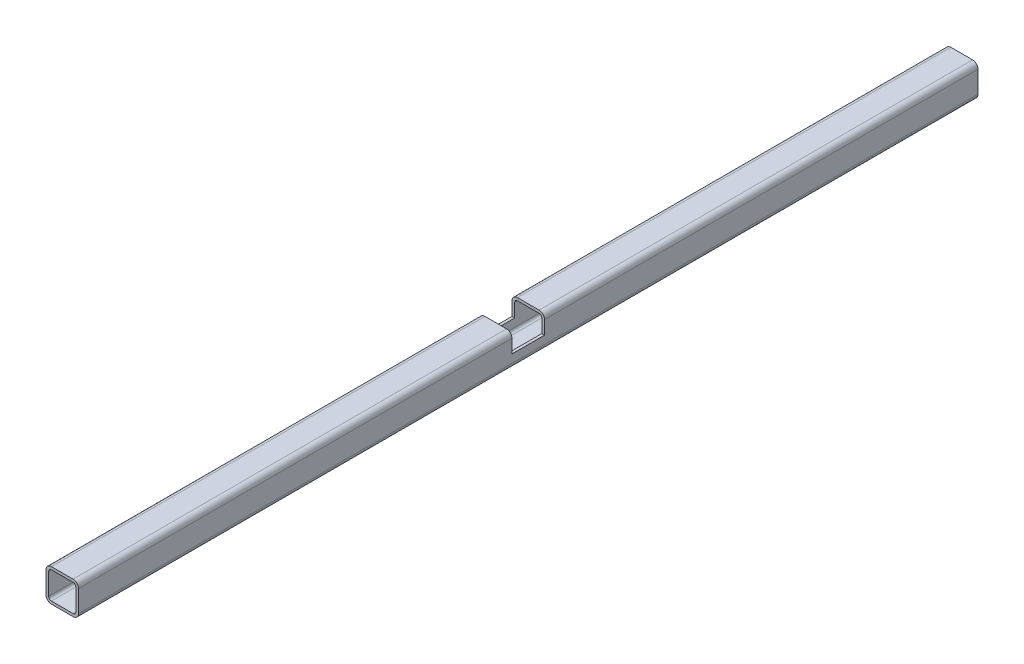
from build123d import *

# Parameters (mm, degrees)
EXTRUSION1_DEPTH = 1660
ESQUISSE1_W      = 60
ESQUISSE1_H      = 35
EXTRUSION2_DEPTH = 1662.354868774


with BuildPart() as part:
    # Sketch1 → Extrusion1 (new body)
    with BuildSketch(Plane.XY):
        with BuildLine():
            Line((-20, -30), (20, -30))
            ThreePointArc((20, -30), (27.071067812, -27.071067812), (30, -20))
            Line((30, -20), (30, 20))
            ThreePointArc((30, 20), (27.071067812, 27.071067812), (20, 30))
            Line((20, 30), (-20, 30))
            ThreePointArc((-20, 30), (-27.071067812, 27.071067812), (-30, 20))
            Line((-30, 20), (-30, -20))
            ThreePointArc((-30, -20), (-27.071067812, -27.071067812), (-20, -30))
        make_face()
        with BuildLine():
            Line((-20, -25), (20, -25))
            ThreePointArc((20, -25), (23.535533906, -23.535533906), (25, -20))
            Line((25, -20), (25, 20))
            ThreePointArc((25, 20), (23.535533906, 23.535533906), (20, 25))
            Line((20, 25), (-20, 25))
            ThreePointArc((-20, 25), (-23.535533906, 23.535533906), (-25, 20))
            Line((-25, 20), (-25, -20))
            ThreePointArc((-25, -20), (-23.535533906, -23.535533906), (-20, -25))
        make_face(mode=Mode.SUBTRACT)
    extrude(amount=EXTRUSION1_DEPTH)

    # Esquisse1 → Extrusion2 (cut, through all)
    with BuildSketch(Plane.ZY.offset(30)):
        with Locations((830, 12.5)):
            Rectangle(ESQUISSE1_W, ESQUISSE1_H)
    extrude(amount=-EXTRUSION2_DEPTH, mode=Mode.SUBTRACT)


solid = part.part
